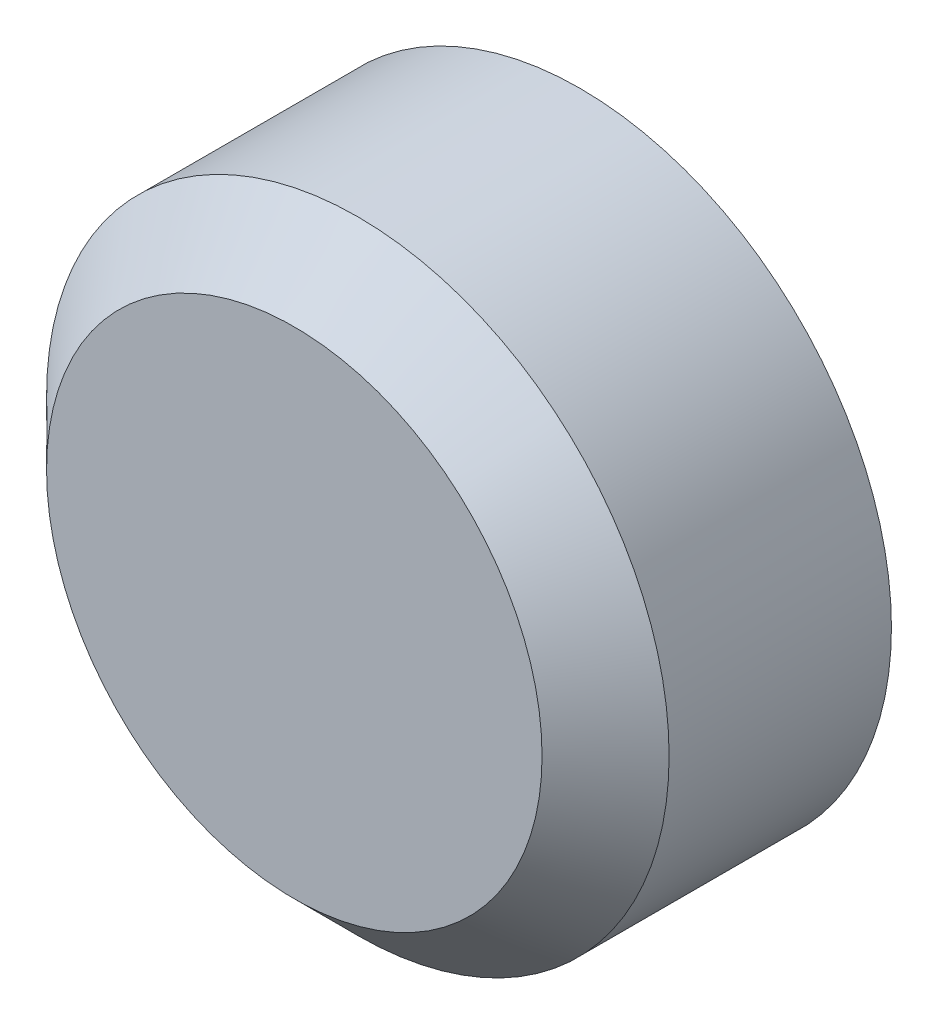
ISO-10303-21;
HEADER;
FILE_DESCRIPTION(('STEP AP214'),'2;1');
FILE_NAME('part.step','',(''),(''),'','','');
FILE_SCHEMA(('AUTOMOTIVE_DESIGN { 1 0 10303 214 1 1 1 1 }'));
ENDSEC;
DATA;
#1=APPLICATION_CONTEXT('core data for automotive mechanical design processes');
#2=APPLICATION_PROTOCOL_DEFINITION('international standard','automotive_design',2000,#1);
#3=PRODUCT_CONTEXT('',#1,'mechanical');
#4=PRODUCT('Part','Part','',(#3));
#5=PRODUCT_RELATED_PRODUCT_CATEGORY('part','',(#4));
#6=PRODUCT_DEFINITION_FORMATION('','',#4);
#7=PRODUCT_DEFINITION_CONTEXT('part definition',#1,'design');
#8=PRODUCT_DEFINITION('design','',#6,#7);
#9=PRODUCT_DEFINITION_SHAPE('','',#8);
#10=(LENGTH_UNIT() NAMED_UNIT(*) SI_UNIT(.MILLI.,.METRE.));
#11=(NAMED_UNIT(*) PLANE_ANGLE_UNIT() SI_UNIT($,.RADIAN.));
#12=(NAMED_UNIT(*) SI_UNIT($,.STERADIAN.) SOLID_ANGLE_UNIT());
#13=UNCERTAINTY_MEASURE_WITH_UNIT(LENGTH_MEASURE(1.E-05),#10,'distance_accuracy_value','');
#14=(GEOMETRIC_REPRESENTATION_CONTEXT(3) GLOBAL_UNCERTAINTY_ASSIGNED_CONTEXT((#13)) GLOBAL_UNIT_ASSIGNED_CONTEXT((#10,
#11,#12)) REPRESENTATION_CONTEXT('',''));
#15=CARTESIAN_POINT('',(0.,0.,0.));
#16=DIRECTION('',(0.,0.,1.));
#17=DIRECTION('',(1.,0.,0.));
#18=AXIS2_PLACEMENT_3D('',#15,#16,#17);
#19=CARTESIAN_POINT('',(0.,0.,9.));
#20=DIRECTION('',(0.,0.,-1.));
#21=DIRECTION('',(-1.,0.,0.));
#22=AXIS2_PLACEMENT_3D('',#19,#20,#21);
#23=CYLINDRICAL_SURFACE('',#22,9.8);
#24=CARTESIAN_POINT('',(0.,0.,7.));
#25=DIRECTION('',(0.,0.,1.));
#26=DIRECTION('',(1.,0.,0.));
#27=AXIS2_PLACEMENT_3D('',#24,#25,#26);
#28=CIRCLE('',#27,9.8);
#29=CARTESIAN_POINT('',(9.8,0.,7.));
#30=VERTEX_POINT('',#29);
#31=EDGE_CURVE('E103',#30,#30,#28,.F.);
#32=ORIENTED_EDGE('',*,*,#31,.T.);
#33=EDGE_LOOP('',(#32));
#34=FACE_BOUND('',#33,.T.);
#35=CARTESIAN_POINT('',(0.,0.,0.));
#36=DIRECTION('',(0.,0.,1.));
#37=DIRECTION('',(1.,0.,0.));
#38=AXIS2_PLACEMENT_3D('',#35,#36,#37);
#39=CIRCLE('',#38,9.8);
#40=CARTESIAN_POINT('',(9.8,0.,0.));
#41=VERTEX_POINT('',#40);
#42=EDGE_CURVE('E96',#41,#41,#39,.T.);
#43=ORIENTED_EDGE('',*,*,#42,.T.);
#44=EDGE_LOOP('',(#43));
#45=FACE_BOUND('',#44,.T.);
#46=ADVANCED_FACE('F35',(#34,#45),#23,.T.);
#47=CARTESIAN_POINT('',(0.,0.,9.));
#48=DIRECTION('',(0.,0.,1.));
#49=DIRECTION('',(1.,0.,0.));
#50=AXIS2_PLACEMENT_3D('',#47,#48,#49);
#51=PLANE('',#50);
#52=CARTESIAN_POINT('',(0.,0.,9.));
#53=DIRECTION('',(0.,0.,1.));
#54=DIRECTION('',(1.,0.,0.));
#55=AXIS2_PLACEMENT_3D('',#52,#53,#54);
#56=CIRCLE('',#55,7.80000000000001);
#57=CARTESIAN_POINT('',(7.80000000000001,0.,9.));
#58=VERTEX_POINT('',#57);
#59=EDGE_CURVE('E100',#58,#58,#56,.T.);
#60=ORIENTED_EDGE('',*,*,#59,.T.);
#61=EDGE_LOOP('',(#60));
#62=FACE_BOUND('',#61,.T.);
#63=ADVANCED_FACE('F130',(#62),#51,.T.);
#64=CARTESIAN_POINT('',(0.,0.,0.));
#65=DIRECTION('',(0.,0.,1.));
#66=DIRECTION('',(1.,0.,0.));
#67=AXIS2_PLACEMENT_3D('',#64,#65,#66);
#68=PLANE('',#67);
#69=DIRECTION('',(-1.,0.,0.));
#70=VECTOR('',#69,1.);
#71=CARTESIAN_POINT('',(0.,5.15,0.));
#72=LINE('',#71,#70);
#73=CARTESIAN_POINT('',(6.50903218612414,5.15,0.));
#74=VERTEX_POINT('',#73);
#75=CARTESIAN_POINT('',(-6.50903218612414,5.15,0.));
#76=VERTEX_POINT('',#75);
#77=EDGE_CURVE('E57',#74,#76,#72,.T.);
#78=ORIENTED_EDGE('',*,*,#77,.T.);
#79=CARTESIAN_POINT('',(0.,0.,0.));
#80=DIRECTION('',(0.,0.,1.));
#81=DIRECTION('',(1.,0.,0.));
#82=AXIS2_PLACEMENT_3D('',#79,#80,#81);
#83=CIRCLE('',#82,8.3);
#84=EDGE_CURVE('E50',#76,#74,#83,.T.);
#85=ORIENTED_EDGE('',*,*,#84,.T.);
#86=EDGE_LOOP('',(#78,#85));
#87=FACE_BOUND('',#86,.T.);
#88=ORIENTED_EDGE('',*,*,#42,.F.);
#89=EDGE_LOOP('',(#88));
#90=FACE_BOUND('',#89,.T.);
#91=ADVANCED_FACE('F132',(#87,#90),#68,.F.);
#92=CARTESIAN_POINT('',(0.,0.,6.5));
#93=DIRECTION('',(0.,0.,-1.));
#94=DIRECTION('',(-1.,0.,0.));
#95=AXIS2_PLACEMENT_3D('',#92,#93,#94);
#96=CYLINDRICAL_SURFACE('',#95,7.8);
#97=DIRECTION('',(0.,0.,-1.));
#98=VECTOR('',#97,1.);
#99=CARTESIAN_POINT('',(6.26238772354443,4.65,6.5));
#100=LINE('',#99,#98);
#101=CARTESIAN_POINT('',(6.26238772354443,4.65,6.5));
#102=VERTEX_POINT('',#101);
#103=CARTESIAN_POINT('',(6.26238772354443,4.65,1.07225346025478));
#104=VERTEX_POINT('',#103);
#105=EDGE_CURVE('E87',#102,#104,#100,.T.);
#106=ORIENTED_EDGE('',*,*,#105,.T.);
#107=CARTESIAN_POINT('',(0.,0.,1.07225346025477));
#108=DIRECTION('',(0.,0.,1.));
#109=DIRECTION('',(1.,0.,0.));
#110=AXIS2_PLACEMENT_3D('',#107,#108,#109);
#111=CIRCLE('',#110,7.8);
#112=CARTESIAN_POINT('',(-6.26238772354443,4.65,1.07225346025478));
#113=VERTEX_POINT('',#112);
#114=EDGE_CURVE('E84',#104,#113,#111,.F.);
#115=ORIENTED_EDGE('',*,*,#114,.T.);
#116=DIRECTION('',(0.,0.,-1.));
#117=VECTOR('',#116,1.);
#118=CARTESIAN_POINT('',(-6.26238772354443,4.65,6.5));
#119=LINE('',#118,#117);
#120=CARTESIAN_POINT('',(-6.26238772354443,4.65,6.5));
#121=VERTEX_POINT('',#120);
#122=EDGE_CURVE('E78',#121,#113,#119,.T.);
#123=ORIENTED_EDGE('',*,*,#122,.F.);
#124=CARTESIAN_POINT('',(0.,0.,6.5));
#125=DIRECTION('',(0.,0.,-1.));
#126=DIRECTION('',(-1.,0.,0.));
#127=AXIS2_PLACEMENT_3D('',#124,#125,#126);
#128=CIRCLE('',#127,7.8);
#129=EDGE_CURVE('E82',#102,#121,#128,.T.);
#130=ORIENTED_EDGE('',*,*,#129,.F.);
#131=EDGE_LOOP('',(#106,#115,#123,#130));
#132=FACE_BOUND('',#131,.T.);
#133=ADVANCED_FACE('F81',(#132),#96,.F.);
#134=CARTESIAN_POINT('',(6.26238772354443,4.65,6.5));
#135=DIRECTION('',(0.,1.,0.));
#136=DIRECTION('',(0.,0.,1.));
#137=AXIS2_PLACEMENT_3D('',#134,#135,#136);
#138=PLANE('',#137);
#139=ORIENTED_EDGE('',*,*,#122,.T.);
#140=DIRECTION('',(1.,0.,0.));
#141=VECTOR('',#140,1.);
#142=CARTESIAN_POINT('',(6.26238772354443,4.65,1.07225346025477));
#143=LINE('',#142,#141);
#144=EDGE_CURVE('E11',#113,#104,#143,.T.);
#145=ORIENTED_EDGE('',*,*,#144,.T.);
#146=ORIENTED_EDGE('',*,*,#105,.F.);
#147=DIRECTION('',(1.,0.,0.));
#148=VECTOR('',#147,1.);
#149=CARTESIAN_POINT('',(6.26238772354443,4.65,6.5));
#150=LINE('',#149,#148);
#151=EDGE_CURVE('E88',#121,#102,#150,.T.);
#152=ORIENTED_EDGE('',*,*,#151,.F.);
#153=EDGE_LOOP('',(#139,#145,#146,#152));
#154=FACE_BOUND('',#153,.T.);
#155=ADVANCED_FACE('F93',(#154),#138,.F.);
#156=CARTESIAN_POINT('',(0.,0.,6.5));
#157=DIRECTION('',(0.,0.,-1.));
#158=DIRECTION('',(-1.,0.,0.));
#159=AXIS2_PLACEMENT_3D('',#156,#157,#158);
#160=PLANE('',#159);
#161=ORIENTED_EDGE('',*,*,#129,.T.);
#162=ORIENTED_EDGE('',*,*,#151,.T.);
#163=EDGE_LOOP('',(#161,#162));
#164=FACE_BOUND('',#163,.T.);
#165=ADVANCED_FACE('F91',(#164),#160,.T.);
#166=CARTESIAN_POINT('',(0.,0.,9.));
#167=DIRECTION('',(0.,0.,-1.));
#168=DIRECTION('',(-1.,0.,0.));
#169=AXIS2_PLACEMENT_3D('',#166,#167,#168);
#170=CONICAL_SURFACE('',#169,7.80000000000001,0.785398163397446);
#171=ORIENTED_EDGE('',*,*,#31,.F.);
#172=EDGE_LOOP('',(#171));
#173=FACE_BOUND('',#172,.T.);
#174=ORIENTED_EDGE('',*,*,#59,.F.);
#175=EDGE_LOOP('',(#174));
#176=FACE_BOUND('',#175,.T.);
#177=ADVANCED_FACE('F121',(#173,#176),#170,.T.);
#178=CARTESIAN_POINT('',(6.26238772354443,4.65,1.07225346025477));
#179=DIRECTION('',(0.,0.90630778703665,0.4226182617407));
#180=DIRECTION('',(1.,0.,0.));
#181=AXIS2_PLACEMENT_3D('',#178,#179,#180);
#182=PLANE('',#181);
#183=CARTESIAN_POINT('',(-6.26238772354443,4.65,1.07225346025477));
#184=CARTESIAN_POINT('',(-6.30425588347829,4.7332663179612,0.893688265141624));
#185=CARTESIAN_POINT('',(-6.3457436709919,4.81656614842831,0.715051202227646));
#186=CARTESIAN_POINT('',(-6.42795849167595,4.98323281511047,0.357633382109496));
#187=CARTESIAN_POINT('',(-6.46868552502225,5.06659965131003,0.178852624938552));
#188=CARTESIAN_POINT('',(-6.50903218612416,5.15,0.));
#189=B_SPLINE_CURVE_WITH_KNOTS('',3,(#183,#184,#185,#186,#187,#188),.UNSPECIFIED.,.F.,.F.,(4,2,
4),(0.,0.604269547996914,1.20853895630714),.UNSPECIFIED.);
#190=EDGE_CURVE('E108',#76,#113,#189,.F.);
#191=ORIENTED_EDGE('',*,*,#190,.F.);
#192=ORIENTED_EDGE('',*,*,#77,.F.);
#193=CARTESIAN_POINT('',(6.50903218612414,5.14999999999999,0.));
#194=CARTESIAN_POINT('',(6.46868552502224,5.06659965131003,0.178852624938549));
#195=CARTESIAN_POINT('',(6.42795849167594,4.98323281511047,0.357633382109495));
#196=CARTESIAN_POINT('',(6.3457436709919,4.81656614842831,0.715051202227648));
#197=CARTESIAN_POINT('',(6.3042558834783,4.7332663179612,0.893688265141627));
#198=CARTESIAN_POINT('',(6.26238772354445,4.65,1.07225346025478));
#199=B_SPLINE_CURVE_WITH_KNOTS('',3,(#193,#194,#195,#196,#197,#198),.UNSPECIFIED.,.F.,.F.,(4,2,
4),(0.,0.604269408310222,1.20853895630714),.UNSPECIFIED.);
#200=EDGE_CURVE('E41',#104,#74,#199,.F.);
#201=ORIENTED_EDGE('',*,*,#200,.F.);
#202=ORIENTED_EDGE('',*,*,#144,.F.);
#203=EDGE_LOOP('',(#191,#192,#201,#202));
#204=FACE_BOUND('',#203,.T.);
#205=ADVANCED_FACE('F38',(#204),#182,.F.);
#206=CARTESIAN_POINT('',(0.,0.,1.07225346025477));
#207=DIRECTION('',(0.,0.,-1.));
#208=DIRECTION('',(-1.,0.,0.));
#209=AXIS2_PLACEMENT_3D('',#206,#207,#208);
#210=CONICAL_SURFACE('',#209,7.8,0.436332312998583);
#211=ORIENTED_EDGE('',*,*,#200,.T.);
#212=ORIENTED_EDGE('',*,*,#84,.F.);
#213=ORIENTED_EDGE('',*,*,#190,.T.);
#214=ORIENTED_EDGE('',*,*,#114,.F.);
#215=EDGE_LOOP('',(#211,#212,#213,#214));
#216=FACE_BOUND('',#215,.T.);
#217=ADVANCED_FACE('F114',(#216),#210,.F.);
#218=CLOSED_SHELL('',(#46,#63,#91,#133,#155,#165,#177,#205,#217));
#219=MANIFOLD_SOLID_BREP('B2',#218);
#220=ADVANCED_BREP_SHAPE_REPRESENTATION('',(#18,#219),#14);
#221=SHAPE_DEFINITION_REPRESENTATION(#9,#220);
ENDSEC;
END-ISO-10303-21;
